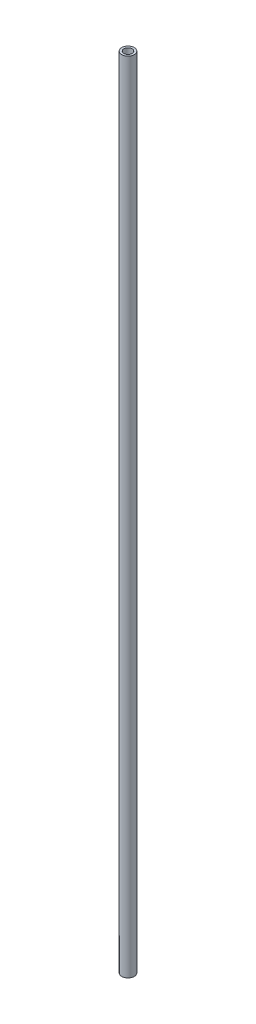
from build123d import *

# Parameters (mm, degrees)
SKETCH1_R           = 2.38125
SKETCH1_R_2         = 1.5621
BOSS_EXTRUDE1_DEPTH = 304.8


with BuildPart() as part:
    # Sketch1 → Boss-Extrude1 (new body)
    with BuildSketch(Plane(origin=(0, 0, 0), x_dir=(1, 0, 0), z_dir=(0, 1, 0))):
        with Locations(Location((0, 0, 0), (0, 0, 90))):
            Circle(SKETCH1_R)
        with Locations(Location((0, 0, 0), (0, 0, 90))):
            Circle(SKETCH1_R_2, mode=Mode.SUBTRACT)
    extrude(amount=BOSS_EXTRUDE1_DEPTH)


solid = part.part
